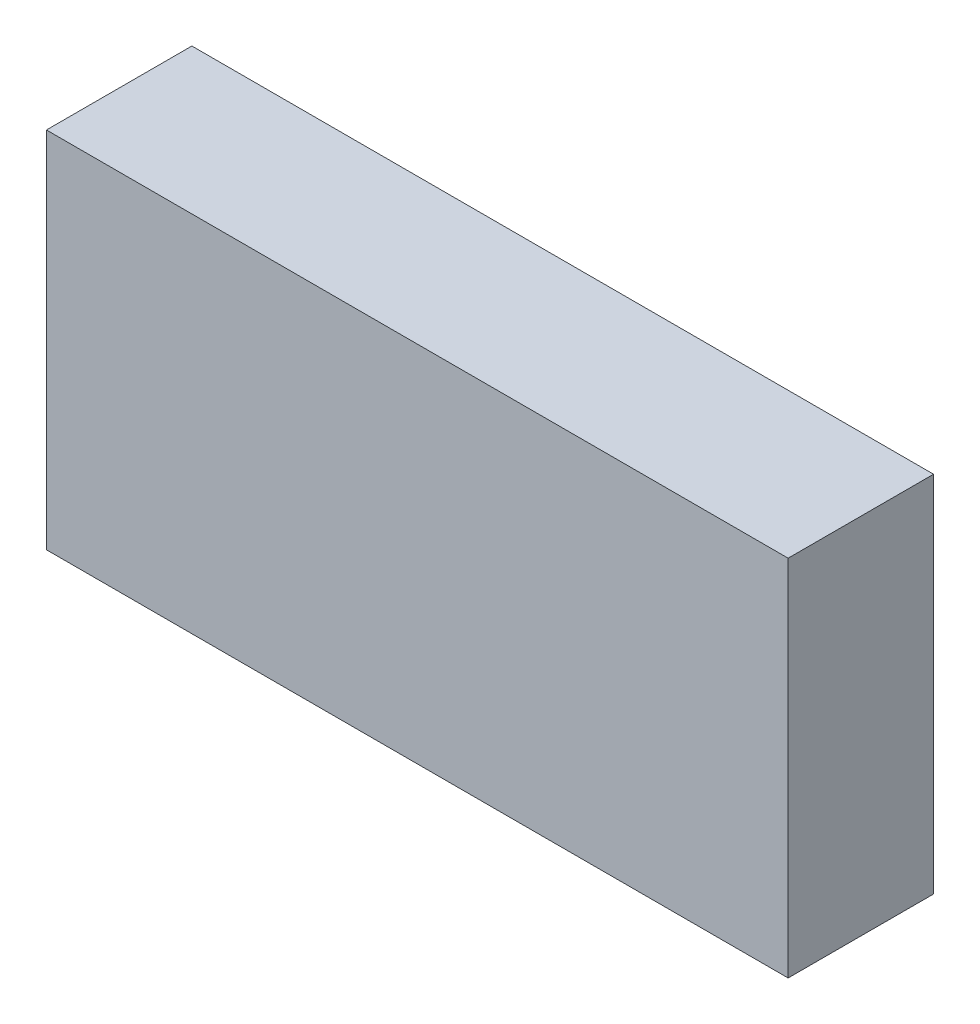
from build123d import *

# Parameters (mm, degrees)
CROQUIS1_W                 = 51
CROQUIS1_H                 = 25
CROQUIS1_W_2               = 39
CROQUIS1_H_2               = 13
SALIENTE_EXTRUIR1_DEPTH    = 6.5
CORTAR_EXTRUIR1_REACH      = 54.91
CROQUIS2_W                 = 4.5
CROQUIS2_H                 = 21
CROQUIS3_W                 = 51
CROQUIS3_H                 = 25
SALIENTE_EXTRUIR2_DEPTH    = 10
CROQUIS4_W                 = 6.7
CROQUIS4_H                 = 19.5
CORTAR_EXTRUIR2_DEPTH      = 38
CORTAR_EXTRUIR3_DEPTH      = 38.084363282
CORTAR_EXTRUIR3_DEPTH_BACK = 38.084363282
CROQUIS5_W                 = 47
CROQUIS5_H                 = 3
CROQUIS7_W                 = 51
CROQUIS7_H                 = 25
CORTAR_EXTRUIR4_DEPTH      = 6.5


with BuildPart() as part:
    # Croquis1 → Saliente-Extruir1 (new body)
    with BuildSketch(Plane.XY):
        Rectangle(CROQUIS1_W, CROQUIS1_H)
        Rectangle(CROQUIS1_W_2, CROQUIS1_H_2, mode=Mode.SUBTRACT)
    extrude(amount=SALIENTE_EXTRUIR1_DEPTH)

    # Cortar-Extruir1: up to this face of the body (flat: up to its plane)
    cortar_extruir1_end = Plane(part.part.faces().sort_by_distance((-25.5, 0, 3.25))[0])
    # Croquis2 → Cortar-Extruir1 (cut, up to the picked face)
    with BuildSketch(Plane(origin=(25.5, 0, 0), x_dir=(0, 0, -1), z_dir=(1, 0, 0)), mode=Mode.PRIVATE) as cortar_extruir1_sk1:
        with Locations((-2.25, 0)):
            Rectangle(CROQUIS2_W, CROQUIS2_H)
    cortar_extruir1_tool1 = split(extrude(cortar_extruir1_sk1.sketch, amount=-CORTAR_EXTRUIR1_REACH, mode=Mode.PRIVATE), bisect_by=cortar_extruir1_end, keep=Keep.BOTH, mode=Mode.PRIVATE)
    add(cortar_extruir1_tool1.solids().sort_by(Axis((25.5, 0, 2.25), (-1, 0, 0)))[0], mode=Mode.SUBTRACT)

    # Croquis3 → Saliente-Extruir2 (add)
    with BuildSketch(Plane(origin=(0, 0, 0), x_dir=(-1, 0, 0), z_dir=(0, 0, -1))):
        Rectangle(CROQUIS3_W, CROQUIS3_H)
    extrude(amount=SALIENTE_EXTRUIR2_DEPTH)

    # Croquis4 → Cortar-Extruir2 (cut)
    with BuildSketch(Plane.ZY.offset(25.5)):
        with Locations((-4.85, 0)):
            Rectangle(CROQUIS4_W, CROQUIS4_H)
    extrude(amount=-CORTAR_EXTRUIR2_DEPTH, mode=Mode.SUBTRACT)

    # Croquis5 → Cortar-Extruir3 (cut, two sides: drawn at the far end of the back side and taken through both)
    with BuildSketch(Plane(origin=(0, -12.5, 0), x_dir=(-1, 0, 0), z_dir=(0, -1, 0)).offset(-CORTAR_EXTRUIR3_DEPTH_BACK)):
        with Locations((0, -3)):
            Rectangle(CROQUIS5_W, CROQUIS5_H)
    extrude(amount=CORTAR_EXTRUIR3_DEPTH + CORTAR_EXTRUIR3_DEPTH_BACK, mode=Mode.SUBTRACT)

    # Croquis7 → Cortar-Extruir4 (cut)
    with BuildSketch(Plane.XY.offset(6.5)):
        Rectangle(CROQUIS7_W, CROQUIS7_H)
    extrude(amount=-CORTAR_EXTRUIR4_DEPTH, mode=Mode.SUBTRACT)


solid = part.part
